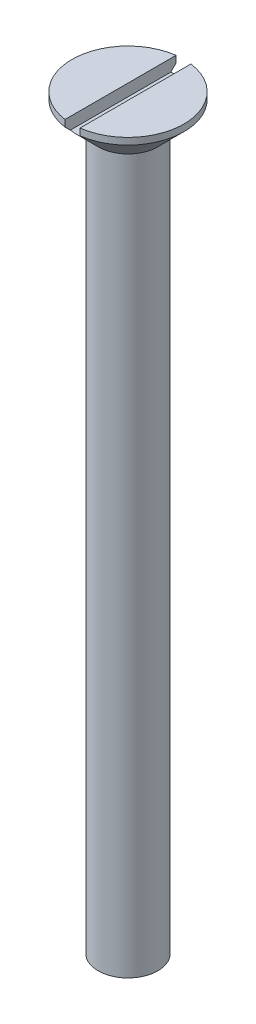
from build123d import *

# Parameters (mm, degrees)
SCHNITT_LINEAR_AUSTRAGEN1_DEPTH      = 51.280463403
SCHNITT_LINEAR_AUSTRAGEN1_DEPTH_BACK = 51.280463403
SKIZZE2_W                            = 1
SKIZZE2_H                            = 0.8


with BuildPart() as part:
    # Skizze1 → Rotation1 (revolve)
    with BuildSketch(Plane.XY):
        Polygon((0, 0), (-2, 0), (-2, 47.8), (-3.75, 49.55), (-3.75, 50), (0, 50), align=None)
    revolve(axis=Axis((0, 50, 0), (0, -1, 0)))

    # Skizze2 → Schnitt-Linear austragen1 (cut, two sides: drawn at the far end of the back side and taken through both)
    with BuildSketch(Plane.XY.offset(-SCHNITT_LINEAR_AUSTRAGEN1_DEPTH_BACK)):
        with Locations((0, 49.6)):
            Rectangle(SKIZZE2_W, SKIZZE2_H)
    extrude(amount=SCHNITT_LINEAR_AUSTRAGEN1_DEPTH + SCHNITT_LINEAR_AUSTRAGEN1_DEPTH_BACK, mode=Mode.SUBTRACT)


solid = part.part
